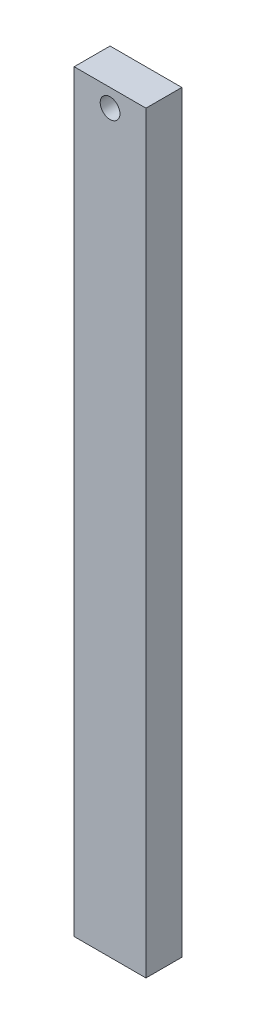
ISO-10303-21;
HEADER;
FILE_DESCRIPTION(('STEP AP214'),'2;1');
FILE_NAME('part.step','',(''),(''),'','','');
FILE_SCHEMA(('AUTOMOTIVE_DESIGN { 1 0 10303 214 1 1 1 1 }'));
ENDSEC;
DATA;
#1=APPLICATION_CONTEXT('core data for automotive mechanical design processes');
#2=APPLICATION_PROTOCOL_DEFINITION('international standard','automotive_design',2000,#1);
#3=PRODUCT_CONTEXT('',#1,'mechanical');
#4=PRODUCT('Part','Part','',(#3));
#5=PRODUCT_RELATED_PRODUCT_CATEGORY('part','',(#4));
#6=PRODUCT_DEFINITION_FORMATION('','',#4);
#7=PRODUCT_DEFINITION_CONTEXT('part definition',#1,'design');
#8=PRODUCT_DEFINITION('design','',#6,#7);
#9=PRODUCT_DEFINITION_SHAPE('','',#8);
#10=(LENGTH_UNIT() NAMED_UNIT(*) SI_UNIT(.MILLI.,.METRE.));
#11=(NAMED_UNIT(*) PLANE_ANGLE_UNIT() SI_UNIT($,.RADIAN.));
#12=(NAMED_UNIT(*) SI_UNIT($,.STERADIAN.) SOLID_ANGLE_UNIT());
#13=UNCERTAINTY_MEASURE_WITH_UNIT(LENGTH_MEASURE(1.E-05),#10,'distance_accuracy_value','');
#14=(GEOMETRIC_REPRESENTATION_CONTEXT(3) GLOBAL_UNCERTAINTY_ASSIGNED_CONTEXT((#13)) GLOBAL_UNIT_ASSIGNED_CONTEXT((#10,
#11,#12)) REPRESENTATION_CONTEXT('',''));
#15=CARTESIAN_POINT('',(0.,0.,0.));
#16=DIRECTION('',(0.,0.,1.));
#17=DIRECTION('',(1.,0.,0.));
#18=AXIS2_PLACEMENT_3D('',#15,#16,#17);
#19=CARTESIAN_POINT('',(-10.,105.,10.));
#20=DIRECTION('',(1.,0.,0.));
#21=DIRECTION('',(0.,1.,0.));
#22=AXIS2_PLACEMENT_3D('',#19,#20,#21);
#23=PLANE('',#22);
#24=DIRECTION('',(0.,-1.,0.));
#25=VECTOR('',#24,1.);
#26=CARTESIAN_POINT('',(-10.,105.,0.));
#27=LINE('',#26,#25);
#28=CARTESIAN_POINT('',(-10.,105.,0.));
#29=VERTEX_POINT('',#28);
#30=CARTESIAN_POINT('',(-9.99999999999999,-105.,0.));
#31=VERTEX_POINT('',#30);
#32=EDGE_CURVE('E100',#29,#31,#27,.T.);
#33=ORIENTED_EDGE('',*,*,#32,.T.);
#34=DIRECTION('',(0.,0.,-1.));
#35=VECTOR('',#34,1.);
#36=CARTESIAN_POINT('',(-9.99999999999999,-105.,10.));
#37=LINE('',#36,#35);
#38=CARTESIAN_POINT('',(-9.99999999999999,-105.,10.));
#39=VERTEX_POINT('',#38);
#40=EDGE_CURVE('E11',#39,#31,#37,.T.);
#41=ORIENTED_EDGE('',*,*,#40,.F.);
#42=DIRECTION('',(0.,-1.,0.));
#43=VECTOR('',#42,1.);
#44=CARTESIAN_POINT('',(-10.,105.,10.));
#45=LINE('',#44,#43);
#46=CARTESIAN_POINT('',(-10.,105.,10.));
#47=VERTEX_POINT('',#46);
#48=EDGE_CURVE('E111',#47,#39,#45,.T.);
#49=ORIENTED_EDGE('',*,*,#48,.F.);
#50=DIRECTION('',(0.,0.,-1.));
#51=VECTOR('',#50,1.);
#52=CARTESIAN_POINT('',(-10.,105.,10.));
#53=LINE('',#52,#51);
#54=EDGE_CURVE('E116',#47,#29,#53,.T.);
#55=ORIENTED_EDGE('',*,*,#54,.T.);
#56=EDGE_LOOP('',(#33,#41,#49,#55));
#57=FACE_BOUND('',#56,.T.);
#58=ADVANCED_FACE('F39',(#57),#23,.F.);
#59=CARTESIAN_POINT('',(10.,-105.,10.));
#60=DIRECTION('',(0.,1.,0.));
#61=DIRECTION('',(-1.,0.,0.));
#62=AXIS2_PLACEMENT_3D('',#59,#60,#61);
#63=PLANE('',#62);
#64=CARTESIAN_POINT('',(0.,-105.,5.));
#65=DIRECTION('',(0.,-1.,0.));
#66=DIRECTION('',(0.,0.,-1.));
#67=AXIS2_PLACEMENT_3D('',#64,#65,#66);
#68=CIRCLE('',#67,2.09999999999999);
#69=CARTESIAN_POINT('',(0.,-105.,2.90000000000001));
#70=VERTEX_POINT('',#69);
#71=EDGE_CURVE('E101',#70,#70,#68,.T.);
#72=ORIENTED_EDGE('',*,*,#71,.F.);
#73=EDGE_LOOP('',(#72));
#74=FACE_BOUND('',#73,.T.);
#75=DIRECTION('',(1.,0.,0.));
#76=VECTOR('',#75,1.);
#77=CARTESIAN_POINT('',(10.,-105.,0.));
#78=LINE('',#77,#76);
#79=CARTESIAN_POINT('',(10.,-105.,0.));
#80=VERTEX_POINT('',#79);
#81=EDGE_CURVE('E104',#31,#80,#78,.T.);
#82=ORIENTED_EDGE('',*,*,#81,.T.);
#83=DIRECTION('',(0.,0.,-1.));
#84=VECTOR('',#83,1.);
#85=CARTESIAN_POINT('',(10.,-105.,10.));
#86=LINE('',#85,#84);
#87=CARTESIAN_POINT('',(10.,-105.,10.));
#88=VERTEX_POINT('',#87);
#89=EDGE_CURVE('E47',#88,#80,#86,.T.);
#90=ORIENTED_EDGE('',*,*,#89,.F.);
#91=DIRECTION('',(1.,0.,0.));
#92=VECTOR('',#91,1.);
#93=CARTESIAN_POINT('',(10.,-105.,10.));
#94=LINE('',#93,#92);
#95=EDGE_CURVE('E86',#39,#88,#94,.T.);
#96=ORIENTED_EDGE('',*,*,#95,.F.);
#97=ORIENTED_EDGE('',*,*,#40,.T.);
#98=EDGE_LOOP('',(#82,#90,#96,#97));
#99=FACE_BOUND('',#98,.T.);
#100=ADVANCED_FACE('F140',(#74,#99),#63,.F.);
#101=CARTESIAN_POINT('',(9.99999999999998,105.,10.));
#102=DIRECTION('',(-1.,0.,0.));
#103=DIRECTION('',(0.,-1.,0.));
#104=AXIS2_PLACEMENT_3D('',#101,#102,#103);
#105=PLANE('',#104);
#106=DIRECTION('',(0.,1.,0.));
#107=VECTOR('',#106,1.);
#108=CARTESIAN_POINT('',(9.99999999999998,105.,0.));
#109=LINE('',#108,#107);
#110=CARTESIAN_POINT('',(9.99999999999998,105.,0.));
#111=VERTEX_POINT('',#110);
#112=EDGE_CURVE('E73',#80,#111,#109,.T.);
#113=ORIENTED_EDGE('',*,*,#112,.T.);
#114=DIRECTION('',(0.,0.,-1.));
#115=VECTOR('',#114,1.);
#116=CARTESIAN_POINT('',(9.99999999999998,105.,10.));
#117=LINE('',#116,#115);
#118=CARTESIAN_POINT('',(9.99999999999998,105.,10.));
#119=VERTEX_POINT('',#118);
#120=EDGE_CURVE('E122',#119,#111,#117,.T.);
#121=ORIENTED_EDGE('',*,*,#120,.F.);
#122=DIRECTION('',(0.,1.,0.));
#123=VECTOR('',#122,1.);
#124=CARTESIAN_POINT('',(9.99999999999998,105.,10.));
#125=LINE('',#124,#123);
#126=EDGE_CURVE('E114',#88,#119,#125,.T.);
#127=ORIENTED_EDGE('',*,*,#126,.F.);
#128=ORIENTED_EDGE('',*,*,#89,.T.);
#129=EDGE_LOOP('',(#113,#121,#127,#128));
#130=FACE_BOUND('',#129,.T.);
#131=ADVANCED_FACE('F124',(#130),#105,.F.);
#132=CARTESIAN_POINT('',(9.99999999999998,105.,10.));
#133=DIRECTION('',(0.,-1.,0.));
#134=DIRECTION('',(1.,0.,0.));
#135=AXIS2_PLACEMENT_3D('',#132,#133,#134);
#136=PLANE('',#135);
#137=DIRECTION('',(-1.,0.,0.));
#138=VECTOR('',#137,1.);
#139=CARTESIAN_POINT('',(9.99999999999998,105.,0.));
#140=LINE('',#139,#138);
#141=EDGE_CURVE('E79',#111,#29,#140,.T.);
#142=ORIENTED_EDGE('',*,*,#141,.T.);
#143=ORIENTED_EDGE('',*,*,#54,.F.);
#144=DIRECTION('',(-1.,0.,0.));
#145=VECTOR('',#144,1.);
#146=CARTESIAN_POINT('',(9.99999999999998,105.,10.));
#147=LINE('',#146,#145);
#148=EDGE_CURVE('E55',#119,#47,#147,.T.);
#149=ORIENTED_EDGE('',*,*,#148,.F.);
#150=ORIENTED_EDGE('',*,*,#120,.T.);
#151=EDGE_LOOP('',(#142,#143,#149,#150));
#152=FACE_BOUND('',#151,.T.);
#153=ADVANCED_FACE('F130',(#152),#136,.F.);
#154=CARTESIAN_POINT('',(0.,0.,10.));
#155=DIRECTION('',(0.,0.,-1.));
#156=DIRECTION('',(-1.,0.,0.));
#157=AXIS2_PLACEMENT_3D('',#154,#155,#156);
#158=PLANE('',#157);
#159=CARTESIAN_POINT('',(0.,100.,10.));
#160=DIRECTION('',(0.,0.,1.));
#161=DIRECTION('',(1.,0.,0.));
#162=AXIS2_PLACEMENT_3D('',#159,#160,#161);
#163=CIRCLE('',#162,2.75);
#164=CARTESIAN_POINT('',(2.75,100.,10.));
#165=VERTEX_POINT('',#164);
#166=EDGE_CURVE('E166',#165,#165,#163,.T.);
#167=ORIENTED_EDGE('',*,*,#166,.F.);
#168=EDGE_LOOP('',(#167));
#169=FACE_BOUND('',#168,.T.);
#170=ORIENTED_EDGE('',*,*,#48,.T.);
#171=ORIENTED_EDGE('',*,*,#95,.T.);
#172=ORIENTED_EDGE('',*,*,#126,.T.);
#173=ORIENTED_EDGE('',*,*,#148,.T.);
#174=EDGE_LOOP('',(#170,#171,#172,#173));
#175=FACE_BOUND('',#174,.T.);
#176=ADVANCED_FACE('F132',(#169,#175),#158,.F.);
#177=CARTESIAN_POINT('',(0.,0.,0.));
#178=DIRECTION('',(0.,0.,-1.));
#179=DIRECTION('',(-1.,0.,0.));
#180=AXIS2_PLACEMENT_3D('',#177,#178,#179);
#181=PLANE('',#180);
#182=CARTESIAN_POINT('',(0.,100.,0.));
#183=DIRECTION('',(0.,0.,1.));
#184=DIRECTION('',(1.,0.,0.));
#185=AXIS2_PLACEMENT_3D('',#182,#183,#184);
#186=CIRCLE('',#185,2.75);
#187=CARTESIAN_POINT('',(2.75,100.,0.));
#188=VERTEX_POINT('',#187);
#189=EDGE_CURVE('E107',#188,#188,#186,.T.);
#190=ORIENTED_EDGE('',*,*,#189,.T.);
#191=EDGE_LOOP('',(#190));
#192=FACE_BOUND('',#191,.T.);
#193=ORIENTED_EDGE('',*,*,#32,.F.);
#194=ORIENTED_EDGE('',*,*,#141,.F.);
#195=ORIENTED_EDGE('',*,*,#112,.F.);
#196=ORIENTED_EDGE('',*,*,#81,.F.);
#197=EDGE_LOOP('',(#193,#194,#195,#196));
#198=FACE_BOUND('',#197,.T.);
#199=ADVANCED_FACE('F94',(#192,#198),#181,.T.);
#200=CARTESIAN_POINT('',(0.,-93.,5.));
#201=DIRECTION('',(0.,-1.,0.));
#202=DIRECTION('',(0.,0.,-1.));
#203=AXIS2_PLACEMENT_3D('',#200,#201,#202);
#204=CONICAL_SURFACE('',#203,2.1,1.02974425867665);
#205=CARTESIAN_POINT('',(0.,-91.7381927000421,5.));
#206=VERTEX_POINT('',#205);
#207=VERTEX_LOOP('',#206);
#208=FACE_BOUND('',#207,.T.);
#209=CARTESIAN_POINT('',(0.,-93.,5.));
#210=DIRECTION('',(0.,-1.,0.));
#211=DIRECTION('',(0.,0.,-1.));
#212=AXIS2_PLACEMENT_3D('',#209,#210,#211);
#213=CIRCLE('',#212,2.1);
#214=CARTESIAN_POINT('',(0.,-93.,2.9));
#215=VERTEX_POINT('',#214);
#216=EDGE_CURVE('E98',#215,#215,#213,.T.);
#217=ORIENTED_EDGE('',*,*,#216,.T.);
#218=EDGE_LOOP('',(#217));
#219=FACE_BOUND('',#218,.T.);
#220=ADVANCED_FACE('F90',(#208,#219),#204,.F.);
#221=CARTESIAN_POINT('',(0.,-105.,5.));
#222=DIRECTION('',(0.,-1.,0.));
#223=DIRECTION('',(0.,0.,-1.));
#224=AXIS2_PLACEMENT_3D('',#221,#222,#223);
#225=CYLINDRICAL_SURFACE('',#224,2.09999999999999);
#226=ORIENTED_EDGE('',*,*,#216,.F.);
#227=EDGE_LOOP('',(#226));
#228=FACE_BOUND('',#227,.T.);
#229=ORIENTED_EDGE('',*,*,#71,.T.);
#230=EDGE_LOOP('',(#229));
#231=FACE_BOUND('',#230,.T.);
#232=ADVANCED_FACE('F93',(#228,#231),#225,.F.);
#233=CARTESIAN_POINT('',(0.,100.,10.));
#234=DIRECTION('',(0.,0.,1.));
#235=DIRECTION('',(1.,0.,0.));
#236=AXIS2_PLACEMENT_3D('',#233,#234,#235);
#237=CYLINDRICAL_SURFACE('',#236,2.75);
#238=ORIENTED_EDGE('',*,*,#189,.F.);
#239=EDGE_LOOP('',(#238));
#240=FACE_BOUND('',#239,.T.);
#241=ORIENTED_EDGE('',*,*,#166,.T.);
#242=EDGE_LOOP('',(#241));
#243=FACE_BOUND('',#242,.T.);
#244=ADVANCED_FACE('F153',(#240,#243),#237,.F.);
#245=CLOSED_SHELL('',(#58,#100,#131,#153,#176,#199,#220,#232,#244));
#246=MANIFOLD_SOLID_BREP('B2',#245);
#247=ADVANCED_BREP_SHAPE_REPRESENTATION('',(#18,#246),#14);
#248=SHAPE_DEFINITION_REPRESENTATION(#9,#247);
ENDSEC;
END-ISO-10303-21;
